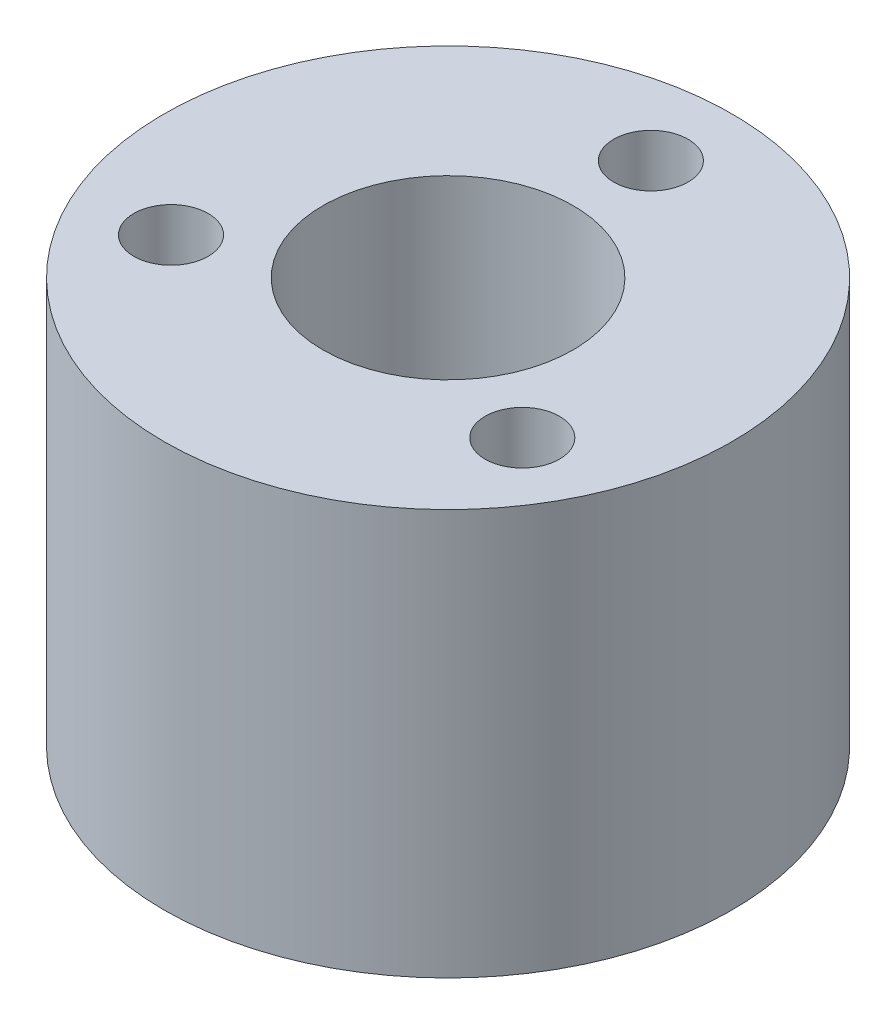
ISO-10303-21;
HEADER;
FILE_DESCRIPTION(('STEP AP214'),'2;1');
FILE_NAME('part.step','',(''),(''),'','','');
FILE_SCHEMA(('AUTOMOTIVE_DESIGN { 1 0 10303 214 1 1 1 1 }'));
ENDSEC;
DATA;
#1=APPLICATION_CONTEXT('core data for automotive mechanical design processes');
#2=APPLICATION_PROTOCOL_DEFINITION('international standard','automotive_design',2000,#1);
#3=PRODUCT_CONTEXT('',#1,'mechanical');
#4=PRODUCT('Part','Part','',(#3));
#5=PRODUCT_RELATED_PRODUCT_CATEGORY('part','',(#4));
#6=PRODUCT_DEFINITION_FORMATION('','',#4);
#7=PRODUCT_DEFINITION_CONTEXT('part definition',#1,'design');
#8=PRODUCT_DEFINITION('design','',#6,#7);
#9=PRODUCT_DEFINITION_SHAPE('','',#8);
#10=(LENGTH_UNIT() NAMED_UNIT(*) SI_UNIT(.MILLI.,.METRE.));
#11=(NAMED_UNIT(*) PLANE_ANGLE_UNIT() SI_UNIT($,.RADIAN.));
#12=(NAMED_UNIT(*) SI_UNIT($,.STERADIAN.) SOLID_ANGLE_UNIT());
#13=UNCERTAINTY_MEASURE_WITH_UNIT(LENGTH_MEASURE(1.E-05),#10,'distance_accuracy_value','');
#14=(GEOMETRIC_REPRESENTATION_CONTEXT(3) GLOBAL_UNCERTAINTY_ASSIGNED_CONTEXT((#13)) GLOBAL_UNIT_ASSIGNED_CONTEXT((#10,
#11,#12)) REPRESENTATION_CONTEXT('',''));
#15=CARTESIAN_POINT('',(0.,0.,0.));
#16=DIRECTION('',(0.,0.,1.));
#17=DIRECTION('',(1.,0.,0.));
#18=AXIS2_PLACEMENT_3D('',#15,#16,#17);
#19=CARTESIAN_POINT('',(0.,15.,0.));
#20=DIRECTION('',(0.,-1.,0.));
#21=DIRECTION('',(0.,0.,-1.));
#22=AXIS2_PLACEMENT_3D('',#19,#20,#21);
#23=CYLINDRICAL_SURFACE('',#22,21.);
#24=CARTESIAN_POINT('',(0.,15.,0.));
#25=DIRECTION('',(0.,1.,0.));
#26=DIRECTION('',(0.,0.,1.));
#27=AXIS2_PLACEMENT_3D('',#24,#25,#26);
#28=CIRCLE('',#27,21.);
#29=CARTESIAN_POINT('',(0.,15.,21.));
#30=VERTEX_POINT('',#29);
#31=EDGE_CURVE('E12',#30,#30,#28,.T.);
#32=ORIENTED_EDGE('',*,*,#31,.F.);
#33=EDGE_LOOP('',(#32));
#34=FACE_BOUND('',#33,.T.);
#35=CARTESIAN_POINT('',(0.,-15.,0.));
#36=DIRECTION('',(0.,1.,0.));
#37=DIRECTION('',(0.,0.,1.));
#38=AXIS2_PLACEMENT_3D('',#35,#36,#37);
#39=CIRCLE('',#38,21.);
#40=CARTESIAN_POINT('',(0.,-15.,21.));
#41=VERTEX_POINT('',#40);
#42=EDGE_CURVE('E54',#41,#41,#39,.T.);
#43=ORIENTED_EDGE('',*,*,#42,.T.);
#44=EDGE_LOOP('',(#43));
#45=FACE_BOUND('',#44,.T.);
#46=ADVANCED_FACE('F51',(#34,#45),#23,.T.);
#47=CARTESIAN_POINT('',(0.,15.,0.));
#48=DIRECTION('',(0.,1.,0.));
#49=DIRECTION('',(0.,0.,1.));
#50=AXIS2_PLACEMENT_3D('',#47,#48,#49);
#51=PLANE('',#50);
#52=CARTESIAN_POINT('',(-12.9903810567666,15.,7.49999999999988));
#53=DIRECTION('',(0.,1.,0.));
#54=DIRECTION('',(0.,0.,1.));
#55=AXIS2_PLACEMENT_3D('',#52,#53,#54);
#56=CIRCLE('',#55,2.75);
#57=CARTESIAN_POINT('',(-12.9903810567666,15.,10.2499999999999));
#58=VERTEX_POINT('',#57);
#59=EDGE_CURVE('E92',#58,#58,#56,.T.);
#60=ORIENTED_EDGE('',*,*,#59,.F.);
#61=EDGE_LOOP('',(#60));
#62=FACE_BOUND('',#61,.T.);
#63=CARTESIAN_POINT('',(12.9903810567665,15.,7.50000000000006));
#64=DIRECTION('',(0.,1.,0.));
#65=DIRECTION('',(0.,0.,1.));
#66=AXIS2_PLACEMENT_3D('',#63,#64,#65);
#67=CIRCLE('',#66,2.75);
#68=CARTESIAN_POINT('',(12.9903810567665,15.,10.2500000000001));
#69=VERTEX_POINT('',#68);
#70=EDGE_CURVE('E85',#69,#69,#67,.T.);
#71=ORIENTED_EDGE('',*,*,#70,.F.);
#72=EDGE_LOOP('',(#71));
#73=FACE_BOUND('',#72,.T.);
#74=CARTESIAN_POINT('',(0.,15.,-15.));
#75=DIRECTION('',(0.,1.,0.));
#76=DIRECTION('',(0.,0.,1.));
#77=AXIS2_PLACEMENT_3D('',#74,#75,#76);
#78=CIRCLE('',#77,2.75);
#79=CARTESIAN_POINT('',(0.,15.,-12.25));
#80=VERTEX_POINT('',#79);
#81=EDGE_CURVE('E78',#80,#80,#78,.T.);
#82=ORIENTED_EDGE('',*,*,#81,.F.);
#83=EDGE_LOOP('',(#82));
#84=FACE_BOUND('',#83,.T.);
#85=CARTESIAN_POINT('',(0.,15.,0.));
#86=DIRECTION('',(0.,1.,0.));
#87=DIRECTION('',(0.,0.,1.));
#88=AXIS2_PLACEMENT_3D('',#85,#86,#87);
#89=CIRCLE('',#88,9.25);
#90=CARTESIAN_POINT('',(0.,15.,9.25));
#91=VERTEX_POINT('',#90);
#92=EDGE_CURVE('E70',#91,#91,#89,.T.);
#93=ORIENTED_EDGE('',*,*,#92,.F.);
#94=EDGE_LOOP('',(#93));
#95=FACE_BOUND('',#94,.T.);
#96=ORIENTED_EDGE('',*,*,#31,.T.);
#97=EDGE_LOOP('',(#96));
#98=FACE_BOUND('',#97,.T.);
#99=ADVANCED_FACE('F99',(#62,#73,#84,#95,#98),#51,.T.);
#100=CARTESIAN_POINT('',(0.,-15.,0.));
#101=DIRECTION('',(0.,1.,0.));
#102=DIRECTION('',(0.,0.,1.));
#103=AXIS2_PLACEMENT_3D('',#100,#101,#102);
#104=PLANE('',#103);
#105=CARTESIAN_POINT('',(-12.9903810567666,-15.,7.49999999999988));
#106=DIRECTION('',(0.,1.,0.));
#107=DIRECTION('',(0.,0.,1.));
#108=AXIS2_PLACEMENT_3D('',#105,#106,#107);
#109=CIRCLE('',#108,2.75);
#110=CARTESIAN_POINT('',(-12.9903810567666,-15.,10.2499999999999));
#111=VERTEX_POINT('',#110);
#112=EDGE_CURVE('E88',#111,#111,#109,.T.);
#113=ORIENTED_EDGE('',*,*,#112,.T.);
#114=EDGE_LOOP('',(#113));
#115=FACE_BOUND('',#114,.T.);
#116=CARTESIAN_POINT('',(12.9903810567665,-15.,7.50000000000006));
#117=DIRECTION('',(0.,1.,0.));
#118=DIRECTION('',(0.,0.,1.));
#119=AXIS2_PLACEMENT_3D('',#116,#117,#118);
#120=CIRCLE('',#119,2.75);
#121=CARTESIAN_POINT('',(12.9903810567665,-15.,10.2500000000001));
#122=VERTEX_POINT('',#121);
#123=EDGE_CURVE('E81',#122,#122,#120,.T.);
#124=ORIENTED_EDGE('',*,*,#123,.T.);
#125=EDGE_LOOP('',(#124));
#126=FACE_BOUND('',#125,.T.);
#127=CARTESIAN_POINT('',(0.,-15.,-15.));
#128=DIRECTION('',(0.,1.,0.));
#129=DIRECTION('',(0.,0.,1.));
#130=AXIS2_PLACEMENT_3D('',#127,#128,#129);
#131=CIRCLE('',#130,2.75);
#132=CARTESIAN_POINT('',(0.,-15.,-12.25));
#133=VERTEX_POINT('',#132);
#134=EDGE_CURVE('E74',#133,#133,#131,.T.);
#135=ORIENTED_EDGE('',*,*,#134,.T.);
#136=EDGE_LOOP('',(#135));
#137=FACE_BOUND('',#136,.T.);
#138=CARTESIAN_POINT('',(0.,-15.,0.));
#139=DIRECTION('',(0.,1.,0.));
#140=DIRECTION('',(0.,0.,1.));
#141=AXIS2_PLACEMENT_3D('',#138,#139,#140);
#142=CIRCLE('',#141,9.24999999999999);
#143=CARTESIAN_POINT('',(0.,-15.,9.24999999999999));
#144=VERTEX_POINT('',#143);
#145=EDGE_CURVE('E65',#144,#144,#142,.T.);
#146=ORIENTED_EDGE('',*,*,#145,.T.);
#147=EDGE_LOOP('',(#146));
#148=FACE_BOUND('',#147,.T.);
#149=ORIENTED_EDGE('',*,*,#42,.F.);
#150=EDGE_LOOP('',(#149));
#151=FACE_BOUND('',#150,.T.);
#152=ADVANCED_FACE('F102',(#115,#126,#137,#148,#151),#104,.F.);
#153=CARTESIAN_POINT('',(0.,15.,0.));
#154=DIRECTION('',(0.,1.,0.));
#155=DIRECTION('',(0.,0.,1.));
#156=AXIS2_PLACEMENT_3D('',#153,#154,#155);
#157=CYLINDRICAL_SURFACE('',#156,9.24999999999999);
#158=ORIENTED_EDGE('',*,*,#145,.F.);
#159=EDGE_LOOP('',(#158));
#160=FACE_BOUND('',#159,.T.);
#161=ORIENTED_EDGE('',*,*,#92,.T.);
#162=EDGE_LOOP('',(#161));
#163=FACE_BOUND('',#162,.T.);
#164=ADVANCED_FACE('F110',(#160,#163),#157,.F.);
#165=CARTESIAN_POINT('',(0.,15.,-15.));
#166=DIRECTION('',(0.,1.,0.));
#167=DIRECTION('',(0.,0.,1.));
#168=AXIS2_PLACEMENT_3D('',#165,#166,#167);
#169=CYLINDRICAL_SURFACE('',#168,2.75);
#170=ORIENTED_EDGE('',*,*,#134,.F.);
#171=EDGE_LOOP('',(#170));
#172=FACE_BOUND('',#171,.T.);
#173=ORIENTED_EDGE('',*,*,#81,.T.);
#174=EDGE_LOOP('',(#173));
#175=FACE_BOUND('',#174,.T.);
#176=ADVANCED_FACE('F112',(#172,#175),#169,.F.);
#177=CARTESIAN_POINT('',(12.9903810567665,15.,7.50000000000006));
#178=DIRECTION('',(0.,1.,0.));
#179=DIRECTION('',(0.,0.,1.));
#180=AXIS2_PLACEMENT_3D('',#177,#178,#179);
#181=CYLINDRICAL_SURFACE('',#180,2.75);
#182=ORIENTED_EDGE('',*,*,#123,.F.);
#183=EDGE_LOOP('',(#182));
#184=FACE_BOUND('',#183,.T.);
#185=ORIENTED_EDGE('',*,*,#70,.T.);
#186=EDGE_LOOP('',(#185));
#187=FACE_BOUND('',#186,.T.);
#188=ADVANCED_FACE('F119',(#184,#187),#181,.F.);
#189=CARTESIAN_POINT('',(-12.9903810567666,15.,7.49999999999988));
#190=DIRECTION('',(0.,1.,0.));
#191=DIRECTION('',(0.,0.,1.));
#192=AXIS2_PLACEMENT_3D('',#189,#190,#191);
#193=CYLINDRICAL_SURFACE('',#192,2.75);
#194=ORIENTED_EDGE('',*,*,#112,.F.);
#195=EDGE_LOOP('',(#194));
#196=FACE_BOUND('',#195,.T.);
#197=ORIENTED_EDGE('',*,*,#59,.T.);
#198=EDGE_LOOP('',(#197));
#199=FACE_BOUND('',#198,.T.);
#200=ADVANCED_FACE('F97',(#196,#199),#193,.F.);
#201=CLOSED_SHELL('',(#46,#99,#152,#164,#176,#188,#200));
#202=MANIFOLD_SOLID_BREP('B2',#201);
#203=ADVANCED_BREP_SHAPE_REPRESENTATION('',(#18,#202),#14);
#204=SHAPE_DEFINITION_REPRESENTATION(#9,#203);
ENDSEC;
END-ISO-10303-21;
